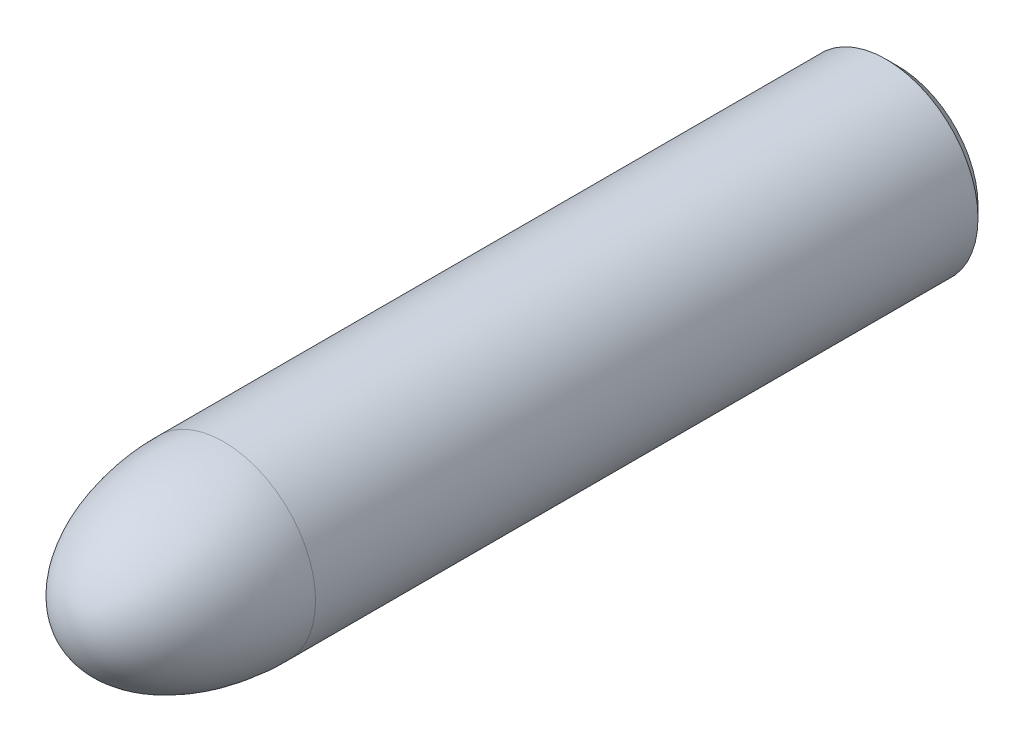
ISO-10303-21;
HEADER;
FILE_DESCRIPTION(('STEP AP214'),'2;1');
FILE_NAME('part.step','',(''),(''),'','','');
FILE_SCHEMA(('AUTOMOTIVE_DESIGN { 1 0 10303 214 1 1 1 1 }'));
ENDSEC;
DATA;
#1=APPLICATION_CONTEXT('core data for automotive mechanical design processes');
#2=APPLICATION_PROTOCOL_DEFINITION('international standard','automotive_design',2000,#1);
#3=PRODUCT_CONTEXT('',#1,'mechanical');
#4=PRODUCT('Part','Part','',(#3));
#5=PRODUCT_RELATED_PRODUCT_CATEGORY('part','',(#4));
#6=PRODUCT_DEFINITION_FORMATION('','',#4);
#7=PRODUCT_DEFINITION_CONTEXT('part definition',#1,'design');
#8=PRODUCT_DEFINITION('design','',#6,#7);
#9=PRODUCT_DEFINITION_SHAPE('','',#8);
#10=(LENGTH_UNIT() NAMED_UNIT(*) SI_UNIT(.MILLI.,.METRE.));
#11=(NAMED_UNIT(*) PLANE_ANGLE_UNIT() SI_UNIT($,.RADIAN.));
#12=(NAMED_UNIT(*) SI_UNIT($,.STERADIAN.) SOLID_ANGLE_UNIT());
#13=UNCERTAINTY_MEASURE_WITH_UNIT(LENGTH_MEASURE(1.E-05),#10,'distance_accuracy_value','');
#14=(GEOMETRIC_REPRESENTATION_CONTEXT(3) GLOBAL_UNCERTAINTY_ASSIGNED_CONTEXT((#13)) GLOBAL_UNIT_ASSIGNED_CONTEXT((#10,
#11,#12)) REPRESENTATION_CONTEXT('',''));
#15=CARTESIAN_POINT('',(0.,0.,0.));
#16=DIRECTION('',(0.,0.,1.));
#17=DIRECTION('',(1.,0.,0.));
#18=AXIS2_PLACEMENT_3D('',#15,#16,#17);
#19=CARTESIAN_POINT('',(0.,0.,-3.3175));
#20=DIRECTION('',(1.,0.,0.));
#21=DIRECTION('',(0.,0.,1.));
#22=AXIS2_PLACEMENT_3D('',#19,#20,#21);
#23=ELLIPSE('',#22,3.3175,2.);
#24=TRIMMED_CURVE('',#23,(PARAMETER_VALUE(3.14159265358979)),
(PARAMETER_VALUE(6.28318530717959)),.T.,.PARAMETER.);
#25=CARTESIAN_POINT('',(0.,0.,0.));
#26=DIRECTION('',(0.,0.,1.));
#27=AXIS1_PLACEMENT('',#25,#26);
#28=SURFACE_OF_REVOLUTION('',#24,#27);
#29=CARTESIAN_POINT('',(0.,0.,0.));
#30=VERTEX_POINT('',#29);
#31=VERTEX_LOOP('',#30);
#32=FACE_BOUND('',#31,.T.);
#33=CARTESIAN_POINT('',(0.,0.,-3.3175));
#34=DIRECTION('',(0.,0.,1.));
#35=DIRECTION('',(1.,0.,0.));
#36=AXIS2_PLACEMENT_3D('',#33,#34,#35);
#37=CIRCLE('',#36,2.);
#38=CARTESIAN_POINT('',(2.,0.,-3.3175));
#39=VERTEX_POINT('',#38);
#40=EDGE_CURVE('E46',#39,#39,#37,.T.);
#41=ORIENTED_EDGE('',*,*,#40,.T.);
#42=EDGE_LOOP('',(#41));
#43=FACE_BOUND('',#42,.T.);
#44=ADVANCED_FACE('F31',(#32,#43),#28,.T.);
#45=CARTESIAN_POINT('',(0.,2.,-18.));
#46=DIRECTION('',(0.,0.,1.));
#47=DIRECTION('',(1.,0.,0.));
#48=AXIS2_PLACEMENT_3D('',#45,#46,#47);
#49=PLANE('',#48);
#50=CARTESIAN_POINT('',(0.,0.,-18.));
#51=DIRECTION('',(0.,0.,1.));
#52=DIRECTION('',(1.,0.,0.));
#53=AXIS2_PLACEMENT_3D('',#50,#51,#52);
#54=CIRCLE('',#53,1.75);
#55=CARTESIAN_POINT('',(1.75,0.,-18.));
#56=VERTEX_POINT('',#55);
#57=EDGE_CURVE('E11',#56,#56,#54,.F.);
#58=ORIENTED_EDGE('',*,*,#57,.T.);
#59=EDGE_LOOP('',(#58));
#60=FACE_BOUND('',#59,.T.);
#61=ADVANCED_FACE('F43',(#60),#49,.F.);
#62=CARTESIAN_POINT('',(0.,0.,0.));
#63=DIRECTION('',(0.,0.,1.));
#64=DIRECTION('',(1.,0.,0.));
#65=AXIS2_PLACEMENT_3D('',#62,#63,#64);
#66=CYLINDRICAL_SURFACE('',#65,2.);
#67=CARTESIAN_POINT('',(0.,0.,-17.75));
#68=DIRECTION('',(0.,0.,1.));
#69=DIRECTION('',(1.,0.,0.));
#70=AXIS2_PLACEMENT_3D('',#67,#68,#69);
#71=CIRCLE('',#70,2.);
#72=CARTESIAN_POINT('',(2.,0.,-17.75));
#73=VERTEX_POINT('',#72);
#74=EDGE_CURVE('E38',#73,#73,#71,.T.);
#75=ORIENTED_EDGE('',*,*,#74,.T.);
#76=EDGE_LOOP('',(#75));
#77=FACE_BOUND('',#76,.T.);
#78=ORIENTED_EDGE('',*,*,#40,.F.);
#79=EDGE_LOOP('',(#78));
#80=FACE_BOUND('',#79,.T.);
#81=ADVANCED_FACE('F55',(#77,#80),#66,.T.);
#82=CARTESIAN_POINT('',(0.,0.,-17.75));
#83=DIRECTION('',(0.,0.,1.));
#84=DIRECTION('',(1.,0.,0.));
#85=AXIS2_PLACEMENT_3D('',#82,#83,#84);
#86=CONICAL_SURFACE('',#85,2.,0.785398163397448);
#87=ORIENTED_EDGE('',*,*,#57,.F.);
#88=EDGE_LOOP('',(#87));
#89=FACE_BOUND('',#88,.T.);
#90=ORIENTED_EDGE('',*,*,#74,.F.);
#91=EDGE_LOOP('',(#90));
#92=FACE_BOUND('',#91,.T.);
#93=ADVANCED_FACE('F33',(#89,#92),#86,.T.);
#94=CLOSED_SHELL('',(#44,#61,#81,#93));
#95=MANIFOLD_SOLID_BREP('B2',#94);
#96=ADVANCED_BREP_SHAPE_REPRESENTATION('',(#18,#95),#14);
#97=SHAPE_DEFINITION_REPRESENTATION(#9,#96);
ENDSEC;
END-ISO-10303-21;
